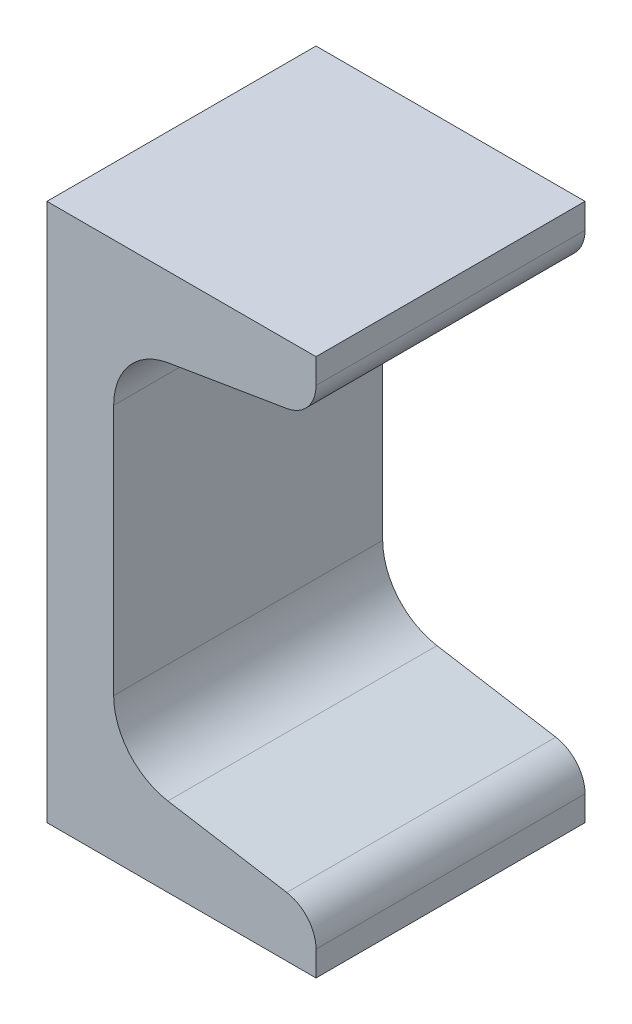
ISO-10303-21;
HEADER;
FILE_DESCRIPTION(('STEP AP214'),'2;1');
FILE_NAME('part.step','',(''),(''),'','','');
FILE_SCHEMA(('AUTOMOTIVE_DESIGN { 1 0 10303 214 1 1 1 1 }'));
ENDSEC;
DATA;
#1=APPLICATION_CONTEXT('core data for automotive mechanical design processes');
#2=APPLICATION_PROTOCOL_DEFINITION('international standard','automotive_design',2000,#1);
#3=PRODUCT_CONTEXT('',#1,'mechanical');
#4=PRODUCT('Part','Part','',(#3));
#5=PRODUCT_RELATED_PRODUCT_CATEGORY('part','',(#4));
#6=PRODUCT_DEFINITION_FORMATION('','',#4);
#7=PRODUCT_DEFINITION_CONTEXT('part definition',#1,'design');
#8=PRODUCT_DEFINITION('design','',#6,#7);
#9=PRODUCT_DEFINITION_SHAPE('','',#8);
#10=(LENGTH_UNIT() NAMED_UNIT(*) SI_UNIT(.MILLI.,.METRE.));
#11=(NAMED_UNIT(*) PLANE_ANGLE_UNIT() SI_UNIT($,.RADIAN.));
#12=(NAMED_UNIT(*) SI_UNIT($,.STERADIAN.) SOLID_ANGLE_UNIT());
#13=UNCERTAINTY_MEASURE_WITH_UNIT(LENGTH_MEASURE(1.E-05),#10,'distance_accuracy_value','');
#14=(GEOMETRIC_REPRESENTATION_CONTEXT(3) GLOBAL_UNCERTAINTY_ASSIGNED_CONTEXT((#13)) GLOBAL_UNIT_ASSIGNED_CONTEXT((#10,
#11,#12)) REPRESENTATION_CONTEXT('',''));
#15=CARTESIAN_POINT('',(0.,0.,0.));
#16=DIRECTION('',(0.,0.,1.));
#17=DIRECTION('',(1.,0.,0.));
#18=AXIS2_PLACEMENT_3D('',#15,#16,#17);
#19=CARTESIAN_POINT('',(0.,0.,12.7));
#20=DIRECTION('',(0.,1.,0.));
#21=DIRECTION('',(0.,0.,1.));
#22=AXIS2_PLACEMENT_3D('',#19,#20,#21);
#23=PLANE('',#22);
#24=DIRECTION('',(1.,0.,0.));
#25=VECTOR('',#24,1.);
#26=CARTESIAN_POINT('',(0.,0.,-12.7));
#27=LINE('',#26,#25);
#28=CARTESIAN_POINT('',(0.,0.,-12.7));
#29=VERTEX_POINT('',#28);
#30=CARTESIAN_POINT('',(25.4,0.,-12.7));
#31=VERTEX_POINT('',#30);
#32=EDGE_CURVE('E159',#29,#31,#27,.T.);
#33=ORIENTED_EDGE('',*,*,#32,.T.);
#34=DIRECTION('',(0.,0.,-1.));
#35=VECTOR('',#34,1.);
#36=CARTESIAN_POINT('',(25.4,0.,12.7));
#37=LINE('',#36,#35);
#38=CARTESIAN_POINT('',(25.4,0.,12.7));
#39=VERTEX_POINT('',#38);
#40=EDGE_CURVE('E11',#39,#31,#37,.T.);
#41=ORIENTED_EDGE('',*,*,#40,.F.);
#42=DIRECTION('',(1.,0.,0.));
#43=VECTOR('',#42,1.);
#44=CARTESIAN_POINT('',(0.,0.,12.7));
#45=LINE('',#44,#43);
#46=CARTESIAN_POINT('',(0.,0.,12.7));
#47=VERTEX_POINT('',#46);
#48=EDGE_CURVE('E189',#47,#39,#45,.T.);
#49=ORIENTED_EDGE('',*,*,#48,.F.);
#50=DIRECTION('',(0.,0.,-1.));
#51=VECTOR('',#50,1.);
#52=CARTESIAN_POINT('',(0.,0.,12.7));
#53=LINE('',#52,#51);
#54=EDGE_CURVE('E55',#47,#29,#53,.T.);
#55=ORIENTED_EDGE('',*,*,#54,.T.);
#56=EDGE_LOOP('',(#33,#41,#49,#55));
#57=FACE_BOUND('',#56,.T.);
#58=ADVANCED_FACE('F39',(#57),#23,.F.);
#59=CARTESIAN_POINT('',(25.4,0.,12.7));
#60=DIRECTION('',(-1.,0.,0.));
#61=DIRECTION('',(0.,0.,1.));
#62=AXIS2_PLACEMENT_3D('',#59,#60,#61);
#63=PLANE('',#62);
#64=DIRECTION('',(0.,1.,0.));
#65=VECTOR('',#64,1.);
#66=CARTESIAN_POINT('',(25.4,0.,-12.7));
#67=LINE('',#66,#65);
#68=CARTESIAN_POINT('',(25.4,2.35762169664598,-12.7));
#69=VERTEX_POINT('',#68);
#70=EDGE_CURVE('E161',#31,#69,#67,.T.);
#71=ORIENTED_EDGE('',*,*,#70,.T.);
#72=DIRECTION('',(0.,0.,-1.));
#73=VECTOR('',#72,1.);
#74=CARTESIAN_POINT('',(25.4,2.35762169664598,12.7));
#75=LINE('',#74,#73);
#76=CARTESIAN_POINT('',(25.4,2.35762169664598,12.7));
#77=VERTEX_POINT('',#76);
#78=EDGE_CURVE('E47',#77,#69,#75,.T.);
#79=ORIENTED_EDGE('',*,*,#78,.F.);
#80=DIRECTION('',(0.,1.,0.));
#81=VECTOR('',#80,1.);
#82=CARTESIAN_POINT('',(25.4,0.,12.7));
#83=LINE('',#82,#81);
#84=EDGE_CURVE('E105',#39,#77,#83,.T.);
#85=ORIENTED_EDGE('',*,*,#84,.F.);
#86=ORIENTED_EDGE('',*,*,#40,.T.);
#87=EDGE_LOOP('',(#71,#79,#85,#86));
#88=FACE_BOUND('',#87,.T.);
#89=ADVANCED_FACE('F251',(#88),#63,.F.);
#90=CARTESIAN_POINT('',(22.098,2.35762169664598,12.7));
#91=DIRECTION('',(0.,0.,-1.));
#92=DIRECTION('',(-1.,0.,0.));
#93=AXIS2_PLACEMENT_3D('',#90,#91,#92);
#94=CYLINDRICAL_SURFACE('',#93,3.30200000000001);
#95=CARTESIAN_POINT('',(22.098,2.35762169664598,-12.7));
#96=DIRECTION('',(0.,0.,1.));
#97=DIRECTION('',(1.,0.,0.));
#98=AXIS2_PLACEMENT_3D('',#95,#96,#97);
#99=CIRCLE('',#98,3.30200000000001);
#100=CARTESIAN_POINT('',(22.6408839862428,5.61468801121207,-12.7));
#101=VERTEX_POINT('',#100);
#102=EDGE_CURVE('E163',#69,#101,#99,.T.);
#103=ORIENTED_EDGE('',*,*,#102,.T.);
#104=DIRECTION('',(0.,0.,-1.));
#105=VECTOR('',#104,1.);
#106=CARTESIAN_POINT('',(22.6408839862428,5.61468801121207,12.7));
#107=LINE('',#106,#105);
#108=CARTESIAN_POINT('',(22.6408839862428,5.61468801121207,12.7));
#109=VERTEX_POINT('',#108);
#110=EDGE_CURVE('E204',#109,#101,#107,.T.);
#111=ORIENTED_EDGE('',*,*,#110,.F.);
#112=CARTESIAN_POINT('',(22.098,2.35762169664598,12.7));
#113=DIRECTION('',(0.,0.,1.));
#114=DIRECTION('',(1.,0.,0.));
#115=AXIS2_PLACEMENT_3D('',#112,#113,#114);
#116=CIRCLE('',#115,3.30200000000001);
#117=EDGE_CURVE('E211',#77,#109,#116,.T.);
#118=ORIENTED_EDGE('',*,*,#117,.F.);
#119=ORIENTED_EDGE('',*,*,#78,.T.);
#120=EDGE_LOOP('',(#103,#111,#118,#119));
#121=FACE_BOUND('',#120,.T.);
#122=ADVANCED_FACE('F209',(#121),#94,.T.);
#123=CARTESIAN_POINT('',(11.4196177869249,7.48503547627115,12.7));
#124=DIRECTION('',(0.16441065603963,0.986391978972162,0.));
#125=DIRECTION('',(-0.986391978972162,0.16441065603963,0.));
#126=AXIS2_PLACEMENT_3D('',#123,#124,#125);
#127=PLANE('',#126);
#128=DIRECTION('',(0.986391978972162,-0.16441065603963,0.));
#129=VECTOR('',#128,1.);
#130=CARTESIAN_POINT('',(11.4196177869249,7.48503547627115,-12.7));
#131=LINE('',#130,#129);
#132=CARTESIAN_POINT('',(11.4196177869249,7.48503547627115,-12.7));
#133=VERTEX_POINT('',#132);
#134=EDGE_CURVE('E166',#133,#101,#131,.T.);
#135=ORIENTED_EDGE('',*,*,#134,.F.);
#136=DIRECTION('',(0.,0.,-1.));
#137=VECTOR('',#136,1.);
#138=CARTESIAN_POINT('',(11.4196177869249,7.48503547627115,12.7));
#139=LINE('',#138,#137);
#140=CARTESIAN_POINT('',(11.4196177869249,7.48503547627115,12.7));
#141=VERTEX_POINT('',#140);
#142=EDGE_CURVE('E202',#141,#133,#139,.T.);
#143=ORIENTED_EDGE('',*,*,#142,.F.);
#144=DIRECTION('',(0.986391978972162,-0.16441065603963,0.));
#145=VECTOR('',#144,1.);
#146=CARTESIAN_POINT('',(11.4196177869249,7.48503547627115,12.7));
#147=LINE('',#146,#145);
#148=EDGE_CURVE('E220',#141,#109,#147,.T.);
#149=ORIENTED_EDGE('',*,*,#148,.T.);
#150=ORIENTED_EDGE('',*,*,#110,.T.);
#151=EDGE_LOOP('',(#135,#143,#149,#150));
#152=FACE_BOUND('',#151,.T.);
#153=ADVANCED_FACE('F217',(#152),#127,.T.);
#154=CARTESIAN_POINT('',(12.4276400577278,13.5327279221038,12.7));
#155=DIRECTION('',(0.,0.,-1.));
#156=DIRECTION('',(-1.,0.,0.));
#157=AXIS2_PLACEMENT_3D('',#154,#155,#156);
#158=CYLINDRICAL_SURFACE('',#157,6.13112492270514);
#159=CARTESIAN_POINT('',(12.4276400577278,13.5327279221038,-12.7));
#160=DIRECTION('',(0.,0.,1.));
#161=DIRECTION('',(1.,0.,0.));
#162=AXIS2_PLACEMENT_3D('',#159,#160,#161);
#163=CIRCLE('',#162,6.13112492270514);
#164=CARTESIAN_POINT('',(6.29651513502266,13.5327279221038,-12.7));
#165=VERTEX_POINT('',#164);
#166=EDGE_CURVE('E169',#165,#133,#163,.T.);
#167=ORIENTED_EDGE('',*,*,#166,.F.);
#168=DIRECTION('',(0.,0.,-1.));
#169=VECTOR('',#168,1.);
#170=CARTESIAN_POINT('',(6.29651513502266,13.5327279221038,12.7));
#171=LINE('',#170,#169);
#172=CARTESIAN_POINT('',(6.29651513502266,13.5327279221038,12.7));
#173=VERTEX_POINT('',#172);
#174=EDGE_CURVE('E200',#173,#165,#171,.T.);
#175=ORIENTED_EDGE('',*,*,#174,.F.);
#176=CARTESIAN_POINT('',(12.4276400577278,13.5327279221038,12.7));
#177=DIRECTION('',(0.,0.,1.));
#178=DIRECTION('',(1.,0.,0.));
#179=AXIS2_PLACEMENT_3D('',#176,#177,#178);
#180=CIRCLE('',#179,6.13112492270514);
#181=EDGE_CURVE('E223',#173,#141,#180,.T.);
#182=ORIENTED_EDGE('',*,*,#181,.T.);
#183=ORIENTED_EDGE('',*,*,#142,.T.);
#184=EDGE_LOOP('',(#167,#175,#182,#183));
#185=FACE_BOUND('',#184,.T.);
#186=ADVANCED_FACE('F264',(#185),#158,.F.);
#187=CARTESIAN_POINT('',(6.29651513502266,37.2672720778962,12.7));
#188=DIRECTION('',(1.,0.,0.));
#189=DIRECTION('',(0.,1.,0.));
#190=AXIS2_PLACEMENT_3D('',#187,#188,#189);
#191=PLANE('',#190);
#192=DIRECTION('',(0.,-1.,0.));
#193=VECTOR('',#192,1.);
#194=CARTESIAN_POINT('',(6.29651513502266,37.2672720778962,-12.7));
#195=LINE('',#194,#193);
#196=CARTESIAN_POINT('',(6.29651513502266,37.2672720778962,-12.7));
#197=VERTEX_POINT('',#196);
#198=EDGE_CURVE('E172',#197,#165,#195,.T.);
#199=ORIENTED_EDGE('',*,*,#198,.F.);
#200=DIRECTION('',(0.,0.,-1.));
#201=VECTOR('',#200,1.);
#202=CARTESIAN_POINT('',(6.29651513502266,37.2672720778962,12.7));
#203=LINE('',#202,#201);
#204=CARTESIAN_POINT('',(6.29651513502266,37.2672720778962,12.7));
#205=VERTEX_POINT('',#204);
#206=EDGE_CURVE('E198',#205,#197,#203,.T.);
#207=ORIENTED_EDGE('',*,*,#206,.F.);
#208=DIRECTION('',(0.,-1.,0.));
#209=VECTOR('',#208,1.);
#210=CARTESIAN_POINT('',(6.29651513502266,37.2672720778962,12.7));
#211=LINE('',#210,#209);
#212=EDGE_CURVE('E225',#205,#173,#211,.T.);
#213=ORIENTED_EDGE('',*,*,#212,.T.);
#214=ORIENTED_EDGE('',*,*,#174,.T.);
#215=EDGE_LOOP('',(#199,#207,#213,#214));
#216=FACE_BOUND('',#215,.T.);
#217=ADVANCED_FACE('F267',(#216),#191,.T.);
#218=CARTESIAN_POINT('',(12.4276400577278,37.2672720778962,12.7));
#219=DIRECTION('',(0.,0.,-1.));
#220=DIRECTION('',(-1.,0.,0.));
#221=AXIS2_PLACEMENT_3D('',#218,#219,#220);
#222=CYLINDRICAL_SURFACE('',#221,6.13112492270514);
#223=CARTESIAN_POINT('',(12.4276400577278,37.2672720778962,-12.7));
#224=DIRECTION('',(0.,0.,-1.));
#225=DIRECTION('',(-1.,0.,0.));
#226=AXIS2_PLACEMENT_3D('',#223,#224,#225);
#227=CIRCLE('',#226,6.13112492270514);
#228=CARTESIAN_POINT('',(11.4196177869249,43.3149645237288,-12.7));
#229=VERTEX_POINT('',#228);
#230=EDGE_CURVE('E175',#197,#229,#227,.T.);
#231=ORIENTED_EDGE('',*,*,#230,.T.);
#232=DIRECTION('',(0.,0.,-1.));
#233=VECTOR('',#232,1.);
#234=CARTESIAN_POINT('',(11.4196177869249,43.3149645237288,12.7));
#235=LINE('',#234,#233);
#236=CARTESIAN_POINT('',(11.4196177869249,43.3149645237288,12.7));
#237=VERTEX_POINT('',#236);
#238=EDGE_CURVE('E195',#237,#229,#235,.T.);
#239=ORIENTED_EDGE('',*,*,#238,.F.);
#240=CARTESIAN_POINT('',(12.4276400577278,37.2672720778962,12.7));
#241=DIRECTION('',(0.,0.,-1.));
#242=DIRECTION('',(-1.,0.,0.));
#243=AXIS2_PLACEMENT_3D('',#240,#241,#242);
#244=CIRCLE('',#243,6.13112492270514);
#245=EDGE_CURVE('E232',#205,#237,#244,.T.);
#246=ORIENTED_EDGE('',*,*,#245,.F.);
#247=ORIENTED_EDGE('',*,*,#206,.T.);
#248=EDGE_LOOP('',(#231,#239,#246,#247));
#249=FACE_BOUND('',#248,.T.);
#250=ADVANCED_FACE('F271',(#249),#222,.F.);
#251=CARTESIAN_POINT('',(11.4196177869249,43.3149645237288,12.7));
#252=DIRECTION('',(-0.164410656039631,0.986391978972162,0.));
#253=DIRECTION('',(-0.986391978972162,-0.164410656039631,0.));
#254=AXIS2_PLACEMENT_3D('',#251,#252,#253);
#255=PLANE('',#254);
#256=DIRECTION('',(0.986391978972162,0.164410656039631,0.));
#257=VECTOR('',#256,1.);
#258=CARTESIAN_POINT('',(11.4196177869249,43.3149645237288,-12.7));
#259=LINE('',#258,#257);
#260=CARTESIAN_POINT('',(22.6408839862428,45.1853119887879,-12.7));
#261=VERTEX_POINT('',#260);
#262=EDGE_CURVE('E177',#229,#261,#259,.T.);
#263=ORIENTED_EDGE('',*,*,#262,.T.);
#264=DIRECTION('',(0.,0.,-1.));
#265=VECTOR('',#264,1.);
#266=CARTESIAN_POINT('',(22.6408839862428,45.1853119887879,12.7));
#267=LINE('',#266,#265);
#268=CARTESIAN_POINT('',(22.6408839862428,45.1853119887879,12.7));
#269=VERTEX_POINT('',#268);
#270=EDGE_CURVE('E193',#269,#261,#267,.T.);
#271=ORIENTED_EDGE('',*,*,#270,.F.);
#272=DIRECTION('',(0.986391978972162,0.164410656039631,0.));
#273=VECTOR('',#272,1.);
#274=CARTESIAN_POINT('',(11.4196177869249,43.3149645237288,12.7));
#275=LINE('',#274,#273);
#276=EDGE_CURVE('E234',#237,#269,#275,.T.);
#277=ORIENTED_EDGE('',*,*,#276,.F.);
#278=ORIENTED_EDGE('',*,*,#238,.T.);
#279=EDGE_LOOP('',(#263,#271,#277,#278));
#280=FACE_BOUND('',#279,.T.);
#281=ADVANCED_FACE('F275',(#280),#255,.F.);
#282=CARTESIAN_POINT('',(22.098,48.442378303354,12.7));
#283=DIRECTION('',(0.,0.,-1.));
#284=DIRECTION('',(-1.,0.,0.));
#285=AXIS2_PLACEMENT_3D('',#282,#283,#284);
#286=CYLINDRICAL_SURFACE('',#285,3.30200000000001);
#287=CARTESIAN_POINT('',(22.098,48.442378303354,-12.7));
#288=DIRECTION('',(0.,0.,-1.));
#289=DIRECTION('',(-1.,0.,0.));
#290=AXIS2_PLACEMENT_3D('',#287,#288,#289);
#291=CIRCLE('',#290,3.30200000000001);
#292=CARTESIAN_POINT('',(25.4,48.442378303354,-12.7));
#293=VERTEX_POINT('',#292);
#294=EDGE_CURVE('E180',#293,#261,#291,.T.);
#295=ORIENTED_EDGE('',*,*,#294,.F.);
#296=DIRECTION('',(0.,0.,-1.));
#297=VECTOR('',#296,1.);
#298=CARTESIAN_POINT('',(25.4,48.442378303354,12.7));
#299=LINE('',#298,#297);
#300=CARTESIAN_POINT('',(25.4,48.442378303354,12.7));
#301=VERTEX_POINT('',#300);
#302=EDGE_CURVE('E142',#301,#293,#299,.T.);
#303=ORIENTED_EDGE('',*,*,#302,.F.);
#304=CARTESIAN_POINT('',(22.098,48.442378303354,12.7));
#305=DIRECTION('',(0.,0.,-1.));
#306=DIRECTION('',(-1.,0.,0.));
#307=AXIS2_PLACEMENT_3D('',#304,#305,#306);
#308=CIRCLE('',#307,3.30200000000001);
#309=EDGE_CURVE('E151',#301,#269,#308,.T.);
#310=ORIENTED_EDGE('',*,*,#309,.T.);
#311=ORIENTED_EDGE('',*,*,#270,.T.);
#312=EDGE_LOOP('',(#295,#303,#310,#311));
#313=FACE_BOUND('',#312,.T.);
#314=ADVANCED_FACE('F237',(#313),#286,.T.);
#315=CARTESIAN_POINT('',(25.4,50.8,12.7));
#316=DIRECTION('',(1.,0.,0.));
#317=DIRECTION('',(0.,1.,0.));
#318=AXIS2_PLACEMENT_3D('',#315,#316,#317);
#319=PLANE('',#318);
#320=DIRECTION('',(0.,-1.,0.));
#321=VECTOR('',#320,1.);
#322=CARTESIAN_POINT('',(25.4,50.8,-12.7));
#323=LINE('',#322,#321);
#324=CARTESIAN_POINT('',(25.4,50.8,-12.7));
#325=VERTEX_POINT('',#324);
#326=EDGE_CURVE('E138',#325,#293,#323,.T.);
#327=ORIENTED_EDGE('',*,*,#326,.F.);
#328=DIRECTION('',(0.,0.,-1.));
#329=VECTOR('',#328,1.);
#330=CARTESIAN_POINT('',(25.4,50.8,12.7));
#331=LINE('',#330,#329);
#332=CARTESIAN_POINT('',(25.4,50.8,12.7));
#333=VERTEX_POINT('',#332);
#334=EDGE_CURVE('E133',#333,#325,#331,.T.);
#335=ORIENTED_EDGE('',*,*,#334,.F.);
#336=DIRECTION('',(0.,-1.,0.));
#337=VECTOR('',#336,1.);
#338=CARTESIAN_POINT('',(25.4,50.8,12.7));
#339=LINE('',#338,#337);
#340=EDGE_CURVE('E136',#333,#301,#339,.T.);
#341=ORIENTED_EDGE('',*,*,#340,.T.);
#342=ORIENTED_EDGE('',*,*,#302,.T.);
#343=EDGE_LOOP('',(#327,#335,#341,#342));
#344=FACE_BOUND('',#343,.T.);
#345=ADVANCED_FACE('F135',(#344),#319,.T.);
#346=CARTESIAN_POINT('',(0.,50.8,12.7));
#347=DIRECTION('',(0.,1.,0.));
#348=DIRECTION('',(0.,0.,1.));
#349=AXIS2_PLACEMENT_3D('',#346,#347,#348);
#350=PLANE('',#349);
#351=DIRECTION('',(1.,0.,0.));
#352=VECTOR('',#351,1.);
#353=CARTESIAN_POINT('',(0.,50.8,-12.7));
#354=LINE('',#353,#352);
#355=CARTESIAN_POINT('',(0.,50.8,-12.7));
#356=VERTEX_POINT('',#355);
#357=EDGE_CURVE('E184',#356,#325,#354,.T.);
#358=ORIENTED_EDGE('',*,*,#357,.F.);
#359=DIRECTION('',(0.,0.,-1.));
#360=VECTOR('',#359,1.);
#361=CARTESIAN_POINT('',(0.,50.8,12.7));
#362=LINE('',#361,#360);
#363=CARTESIAN_POINT('',(0.,50.8,12.7));
#364=VERTEX_POINT('',#363);
#365=EDGE_CURVE('E93',#364,#356,#362,.T.);
#366=ORIENTED_EDGE('',*,*,#365,.F.);
#367=DIRECTION('',(1.,0.,0.));
#368=VECTOR('',#367,1.);
#369=CARTESIAN_POINT('',(0.,50.8,12.7));
#370=LINE('',#369,#368);
#371=EDGE_CURVE('E149',#364,#333,#370,.T.);
#372=ORIENTED_EDGE('',*,*,#371,.T.);
#373=ORIENTED_EDGE('',*,*,#334,.T.);
#374=EDGE_LOOP('',(#358,#366,#372,#373));
#375=FACE_BOUND('',#374,.T.);
#376=ADVANCED_FACE('F153',(#375),#350,.T.);
#377=CARTESIAN_POINT('',(0.,0.,12.7));
#378=DIRECTION('',(-1.,0.,0.));
#379=DIRECTION('',(0.,0.,1.));
#380=AXIS2_PLACEMENT_3D('',#377,#378,#379);
#381=PLANE('',#380);
#382=DIRECTION('',(0.,1.,0.));
#383=VECTOR('',#382,1.);
#384=CARTESIAN_POINT('',(0.,0.,-12.7));
#385=LINE('',#384,#383);
#386=EDGE_CURVE('E186',#29,#356,#385,.T.);
#387=ORIENTED_EDGE('',*,*,#386,.F.);
#388=ORIENTED_EDGE('',*,*,#54,.F.);
#389=DIRECTION('',(0.,1.,0.));
#390=VECTOR('',#389,1.);
#391=CARTESIAN_POINT('',(0.,0.,12.7));
#392=LINE('',#391,#390);
#393=EDGE_CURVE('E154',#47,#364,#392,.T.);
#394=ORIENTED_EDGE('',*,*,#393,.T.);
#395=ORIENTED_EDGE('',*,*,#365,.T.);
#396=EDGE_LOOP('',(#387,#388,#394,#395));
#397=FACE_BOUND('',#396,.T.);
#398=ADVANCED_FACE('F240',(#397),#381,.T.);
#399=CARTESIAN_POINT('',(22.098,2.35762169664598,12.7));
#400=DIRECTION('',(0.,0.,1.));
#401=DIRECTION('',(1.,0.,0.));
#402=AXIS2_PLACEMENT_3D('',#399,#400,#401);
#403=PLANE('',#402);
#404=ORIENTED_EDGE('',*,*,#48,.T.);
#405=ORIENTED_EDGE('',*,*,#84,.T.);
#406=ORIENTED_EDGE('',*,*,#117,.T.);
#407=ORIENTED_EDGE('',*,*,#148,.F.);
#408=ORIENTED_EDGE('',*,*,#181,.F.);
#409=ORIENTED_EDGE('',*,*,#212,.F.);
#410=ORIENTED_EDGE('',*,*,#245,.T.);
#411=ORIENTED_EDGE('',*,*,#276,.T.);
#412=ORIENTED_EDGE('',*,*,#309,.F.);
#413=ORIENTED_EDGE('',*,*,#340,.F.);
#414=ORIENTED_EDGE('',*,*,#371,.F.);
#415=ORIENTED_EDGE('',*,*,#393,.F.);
#416=EDGE_LOOP('',(#404,#405,#406,#407,#408,#409,#410,#411,#412,#413,#414,#415));
#417=FACE_BOUND('',#416,.T.);
#418=ADVANCED_FACE('F147',(#417),#403,.T.);
#419=CARTESIAN_POINT('',(22.098,2.35762169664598,-12.7));
#420=DIRECTION('',(0.,0.,1.));
#421=DIRECTION('',(1.,0.,0.));
#422=AXIS2_PLACEMENT_3D('',#419,#420,#421);
#423=PLANE('',#422);
#424=ORIENTED_EDGE('',*,*,#32,.F.);
#425=ORIENTED_EDGE('',*,*,#386,.T.);
#426=ORIENTED_EDGE('',*,*,#357,.T.);
#427=ORIENTED_EDGE('',*,*,#326,.T.);
#428=ORIENTED_EDGE('',*,*,#294,.T.);
#429=ORIENTED_EDGE('',*,*,#262,.F.);
#430=ORIENTED_EDGE('',*,*,#230,.F.);
#431=ORIENTED_EDGE('',*,*,#198,.T.);
#432=ORIENTED_EDGE('',*,*,#166,.T.);
#433=ORIENTED_EDGE('',*,*,#134,.T.);
#434=ORIENTED_EDGE('',*,*,#102,.F.);
#435=ORIENTED_EDGE('',*,*,#70,.F.);
#436=EDGE_LOOP('',(#424,#425,#426,#427,#428,#429,#430,#431,#432,#433,#434,#435));
#437=FACE_BOUND('',#436,.T.);
#438=ADVANCED_FACE('F213',(#437),#423,.F.);
#439=CLOSED_SHELL('',(#58,#89,#122,#153,#186,#217,#250,#281,#314,#345,#376,#398,#418,#438));
#440=MANIFOLD_SOLID_BREP('B2',#439);
#441=ADVANCED_BREP_SHAPE_REPRESENTATION('',(#18,#440),#14);
#442=SHAPE_DEFINITION_REPRESENTATION(#9,#441);
ENDSEC;
END-ISO-10303-21;
